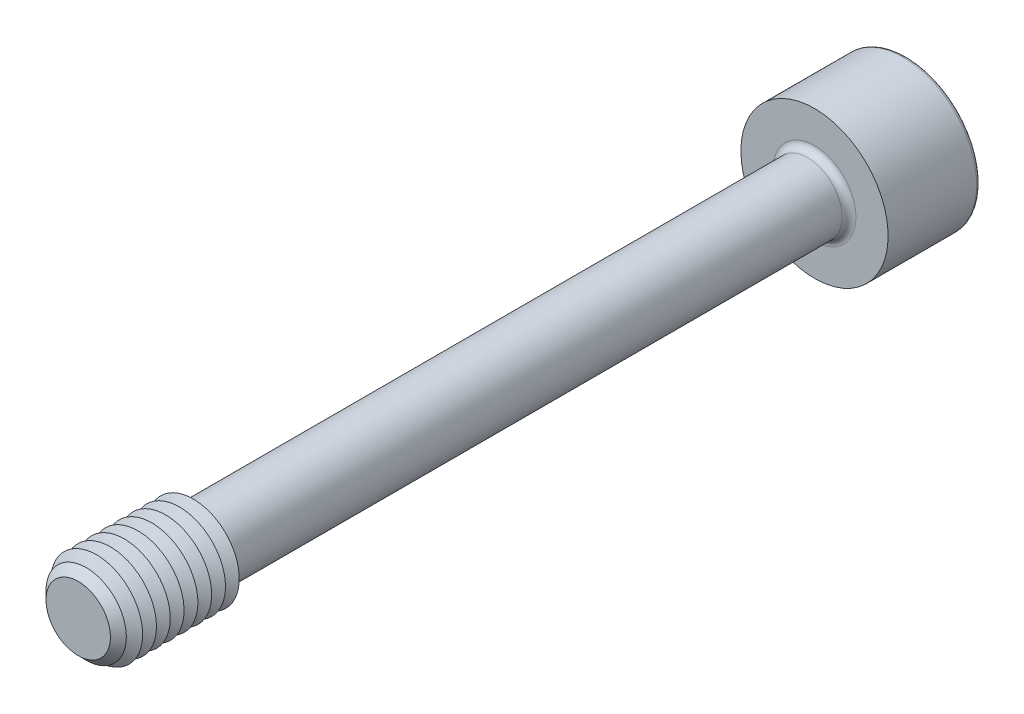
from build123d import *

# Parameters (mm, degrees)
SKETCH1_R       = 3.75
EXTRUDE1_DEPTH  = 40
CHAMFER1_SIZE   = 1.5
SKETCH3_R       = 8
EXTRUDE2_DEPTH  = 10
EXTRUDE3_DEPTH  = 8
FILLET1_R       = 0.75
FILLET2_R       = 0.375
LPATTERN1_COUNT = 8
LPATTERN1_PITCH = 1.5


with BuildPart() as part:
    # Sketch1 → Extrude1 (new, symmetric)
    with BuildSketch(Plane.XY):
        Circle(SKETCH1_R)
    extrude(amount=EXTRUDE1_DEPTH, both=True)

    # Sketch2 → Revolve1 (revolve)
    with BuildSketch(Plane(origin=(0, 0, 0), x_dir=(0, 0, -1), z_dir=(1, 0, 0))):
        Polygon((-40, 0), (-40, 5), (-27.5, 5), (-26.778312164, 3.75), (-26.778312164, 0), align=None)
    revolve(axis=Axis((0, 0, 26.778312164), (0, 0, 1)))

    # Chamfer1
    chamfer1_edges = [part.edges().sort_by_distance(p)[0] for p in [
        (0, -5, 40),
    ]]
    chamfer(chamfer1_edges, length=CHAMFER1_SIZE)

    # Sketch3 → Extrude2 (add)
    with BuildSketch(Plane(origin=(0, 0, -40), x_dir=(-1, 0, 0), z_dir=(0, 0, -1))):
        Circle(SKETCH3_R)
    extrude(amount=EXTRUDE2_DEPTH)

    # Sketch4 → Extrude3 (cut)
    with BuildSketch(Plane(origin=(-13.7, 0, -50), x_dir=(1, 0, 0), z_dir=(0, 0, 1))):
        Polygon((11.390598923, -4), (16.009401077, -4), (18.318802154, 0), (16.009401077, 4), (11.390598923, 4), (9.081197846, 0), align=None)
    extrude(amount=EXTRUDE3_DEPTH, mode=Mode.SUBTRACT)

    # Fillet1
    fillet1_edges = [part.edges().sort_by_distance(p)[0] for p in [
        (-3.75, 0, -40),
    ]]
    fillet(fillet1_edges, radius=FILLET1_R)

    # Fillet2
    fillet2_edges = [part.edges().sort_by_distance(p)[0] for p in [
        (8, 0, -50),
    ]]
    fillet(fillet2_edges, radius=FILLET2_R)

    # Sketch5 → Cut-Revolve1 (revolve, cut)
    with BuildSketch(Plane(origin=(0, 0, 0), x_dir=(0, 0, -1), z_dir=(1, 0, 0)), mode=Mode.PRIVATE) as cut_revolve1_sk:
        Polygon((42, 0), (42, -4), (39.690598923, 0), align=None)
    revolve(cut_revolve1_sk.sketch.rotate(Axis((0, 0, -39.690598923), (0, 0, -1)), 90), axis=Axis((0, 0, -39.690598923), (0, 0, -1)), mode=Mode.SUBTRACT)

    # Sketch7 → Cut-Revolve2 (revolve, cut)
    with BuildSketch(Plane(origin=(0, 0, 0), x_dir=(0, 0, -1), z_dir=(1, 0, 0)), mode=Mode.PRIVATE) as cut_revolve2_sk:
        Polygon((-27.5, 5), (-28.25, 3.700961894), (-29, 5), align=None)
    cut_revolve2 = revolve(cut_revolve2_sk.sketch.rotate(Axis((0, 0, -1.332048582), (0, 0, 1)), 90), axis=Axis((0, 0, -1.332048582), (0, 0, 1)), mode=Mode.SUBTRACT)

    # LPattern1: Cut-Revolve2 ×8
    with Locations(*[(0, 0, i * LPATTERN1_PITCH) for i in range(1, LPATTERN1_COUNT)]):
        add(cut_revolve2, mode=Mode.SUBTRACT)


solid = part.part
